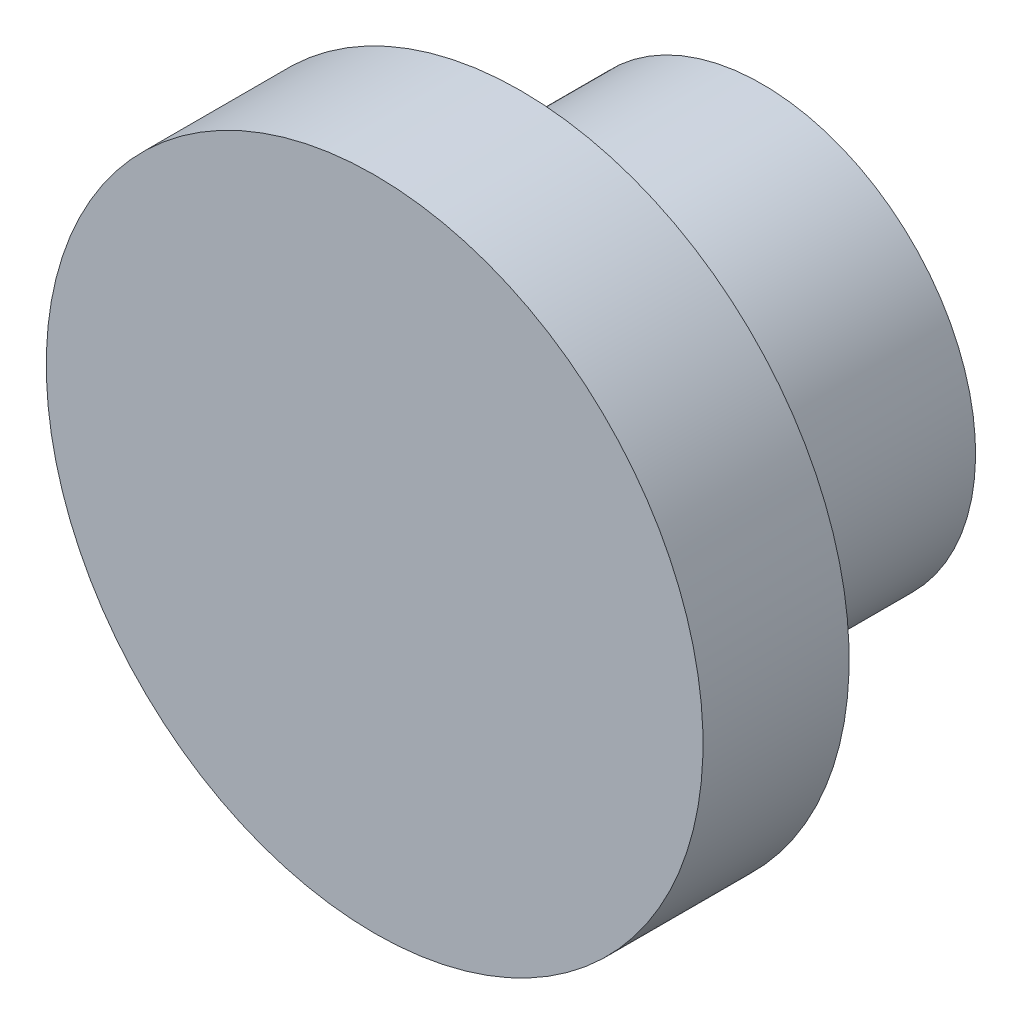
ISO-10303-21;
HEADER;
FILE_DESCRIPTION(('STEP AP214'),'2;1');
FILE_NAME('part.step','',(''),(''),'','','');
FILE_SCHEMA(('AUTOMOTIVE_DESIGN { 1 0 10303 214 1 1 1 1 }'));
ENDSEC;
DATA;
#1=APPLICATION_CONTEXT('core data for automotive mechanical design processes');
#2=APPLICATION_PROTOCOL_DEFINITION('international standard','automotive_design',2000,#1);
#3=PRODUCT_CONTEXT('',#1,'mechanical');
#4=PRODUCT('Part','Part','',(#3));
#5=PRODUCT_RELATED_PRODUCT_CATEGORY('part','',(#4));
#6=PRODUCT_DEFINITION_FORMATION('','',#4);
#7=PRODUCT_DEFINITION_CONTEXT('part definition',#1,'design');
#8=PRODUCT_DEFINITION('design','',#6,#7);
#9=PRODUCT_DEFINITION_SHAPE('','',#8);
#10=(LENGTH_UNIT() NAMED_UNIT(*) SI_UNIT(.MILLI.,.METRE.));
#11=(NAMED_UNIT(*) PLANE_ANGLE_UNIT() SI_UNIT($,.RADIAN.));
#12=(NAMED_UNIT(*) SI_UNIT($,.STERADIAN.) SOLID_ANGLE_UNIT());
#13=UNCERTAINTY_MEASURE_WITH_UNIT(LENGTH_MEASURE(1.E-05),#10,'distance_accuracy_value','');
#14=(GEOMETRIC_REPRESENTATION_CONTEXT(3) GLOBAL_UNCERTAINTY_ASSIGNED_CONTEXT((#13)) GLOBAL_UNIT_ASSIGNED_CONTEXT((#10,
#11,#12)) REPRESENTATION_CONTEXT('',''));
#15=CARTESIAN_POINT('',(0.,0.,0.));
#16=DIRECTION('',(0.,0.,1.));
#17=DIRECTION('',(1.,0.,0.));
#18=AXIS2_PLACEMENT_3D('',#15,#16,#17);
#19=CARTESIAN_POINT('',(0.,0.,-12.8268423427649));
#20=DIRECTION('',(0.,0.,1.));
#21=DIRECTION('',(0.,1.,0.));
#22=AXIS2_PLACEMENT_3D('',#19,#20,#21);
#23=CYLINDRICAL_SURFACE('',#22,13.);
#24=CARTESIAN_POINT('',(0.,0.,-36.4268423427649));
#25=DIRECTION('',(0.,0.,-1.));
#26=DIRECTION('',(0.,-1.,0.));
#27=AXIS2_PLACEMENT_3D('',#24,#25,#26);
#28=CIRCLE('',#27,13.);
#29=CARTESIAN_POINT('',(0.,-13.,-36.4268423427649));
#30=VERTEX_POINT('',#29);
#31=EDGE_CURVE('E10',#30,#30,#28,.F.);
#32=ORIENTED_EDGE('',*,*,#31,.T.);
#33=EDGE_LOOP('',(#32));
#34=FACE_BOUND('',#33,.T.);
#35=CARTESIAN_POINT('',(0.,0.,-21.7268423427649));
#36=DIRECTION('',(0.,0.,-1.));
#37=DIRECTION('',(0.,-1.,0.));
#38=AXIS2_PLACEMENT_3D('',#35,#36,#37);
#39=CIRCLE('',#38,13.);
#40=CARTESIAN_POINT('',(0.,-13.,-21.7268423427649));
#41=VERTEX_POINT('',#40);
#42=EDGE_CURVE('E38',#41,#41,#39,.T.);
#43=ORIENTED_EDGE('',*,*,#42,.T.);
#44=EDGE_LOOP('',(#43));
#45=FACE_BOUND('',#44,.T.);
#46=ADVANCED_FACE('F15',(#34,#45),#23,.T.);
#47=CARTESIAN_POINT('',(0.,0.,-12.8268423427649));
#48=DIRECTION('',(0.,0.,1.));
#49=DIRECTION('',(0.,1.,0.));
#50=AXIS2_PLACEMENT_3D('',#47,#48,#49);
#51=CYLINDRICAL_SURFACE('',#50,9.5);
#52=CARTESIAN_POINT('',(0.,0.,-34.9268423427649));
#53=DIRECTION('',(0.,0.,1.));
#54=DIRECTION('',(0.,1.,0.));
#55=AXIS2_PLACEMENT_3D('',#52,#53,#54);
#56=CIRCLE('',#55,9.5);
#57=CARTESIAN_POINT('',(0.,9.5,-34.9268423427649));
#58=VERTEX_POINT('',#57);
#59=EDGE_CURVE('E26',#58,#58,#56,.T.);
#60=ORIENTED_EDGE('',*,*,#59,.T.);
#61=EDGE_LOOP('',(#60));
#62=FACE_BOUND('',#61,.T.);
#63=CARTESIAN_POINT('',(0.,0.,-36.4268423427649));
#64=DIRECTION('',(0.,0.,1.));
#65=DIRECTION('',(0.,1.,0.));
#66=AXIS2_PLACEMENT_3D('',#63,#64,#65);
#67=CIRCLE('',#66,9.5);
#68=CARTESIAN_POINT('',(0.,9.5,-36.4268423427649));
#69=VERTEX_POINT('',#68);
#70=EDGE_CURVE('E22',#69,#69,#67,.T.);
#71=ORIENTED_EDGE('',*,*,#70,.F.);
#72=EDGE_LOOP('',(#71));
#73=FACE_BOUND('',#72,.T.);
#74=ADVANCED_FACE('F17',(#62,#73),#51,.F.);
#75=CARTESIAN_POINT('',(-9.5,0.,-12.8268423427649));
#76=DIRECTION('',(0.,0.,1.));
#77=DIRECTION('',(0.,1.,0.));
#78=AXIS2_PLACEMENT_3D('',#75,#76,#77);
#79=PLANE('',#78);
#80=CARTESIAN_POINT('',(0.,0.,-12.8268423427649));
#81=DIRECTION('',(0.,0.,-1.));
#82=DIRECTION('',(0.,-1.,0.));
#83=AXIS2_PLACEMENT_3D('',#80,#81,#82);
#84=CIRCLE('',#83,20.);
#85=CARTESIAN_POINT('',(0.,-20.,-12.8268423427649));
#86=VERTEX_POINT('',#85);
#87=EDGE_CURVE('E44',#86,#86,#84,.T.);
#88=ORIENTED_EDGE('',*,*,#87,.F.);
#89=EDGE_LOOP('',(#88));
#90=FACE_BOUND('',#89,.T.);
#91=ADVANCED_FACE('F72',(#90),#79,.T.);
#92=CARTESIAN_POINT('',(-13.,0.,-36.4268423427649));
#93=DIRECTION('',(0.,0.,-1.));
#94=DIRECTION('',(0.,-1.,0.));
#95=AXIS2_PLACEMENT_3D('',#92,#93,#94);
#96=PLANE('',#95);
#97=ORIENTED_EDGE('',*,*,#31,.F.);
#98=EDGE_LOOP('',(#97));
#99=FACE_BOUND('',#98,.T.);
#100=ORIENTED_EDGE('',*,*,#70,.T.);
#101=EDGE_LOOP('',(#100));
#102=FACE_BOUND('',#101,.T.);
#103=ADVANCED_FACE('F76',(#99,#102),#96,.T.);
#104=CARTESIAN_POINT('',(0.,0.,-30.4268423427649));
#105=DIRECTION('',(0.,0.,1.));
#106=DIRECTION('',(0.,1.,0.));
#107=AXIS2_PLACEMENT_3D('',#104,#105,#106);
#108=CONICAL_SURFACE('',#107,10.2934714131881,0.174532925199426);
#109=ORIENTED_EDGE('',*,*,#59,.F.);
#110=EDGE_LOOP('',(#109));
#111=FACE_BOUND('',#110,.T.);
#112=CARTESIAN_POINT('',(0.,0.,-30.4268423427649));
#113=DIRECTION('',(0.,0.,1.));
#114=DIRECTION('',(0.,1.,0.));
#115=AXIS2_PLACEMENT_3D('',#112,#113,#114);
#116=CIRCLE('',#115,10.2934714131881);
#117=CARTESIAN_POINT('',(0.,10.2934714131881,-30.4268423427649));
#118=VERTEX_POINT('',#117);
#119=EDGE_CURVE('E30',#118,#118,#116,.T.);
#120=ORIENTED_EDGE('',*,*,#119,.T.);
#121=EDGE_LOOP('',(#120));
#122=FACE_BOUND('',#121,.T.);
#123=ADVANCED_FACE('F84',(#111,#122),#108,.F.);
#124=CARTESIAN_POINT('',(-10.2934714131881,0.,-30.4268423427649));
#125=DIRECTION('',(0.,0.,-1.));
#126=DIRECTION('',(0.,-1.,0.));
#127=AXIS2_PLACEMENT_3D('',#124,#125,#126);
#128=PLANE('',#127);
#129=ORIENTED_EDGE('',*,*,#119,.F.);
#130=EDGE_LOOP('',(#129));
#131=FACE_BOUND('',#130,.T.);
#132=CARTESIAN_POINT('',(0.,0.,-30.4268423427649));
#133=DIRECTION('',(0.,0.,1.));
#134=DIRECTION('',(0.,1.,0.));
#135=AXIS2_PLACEMENT_3D('',#132,#133,#134);
#136=CIRCLE('',#135,11.6);
#137=CARTESIAN_POINT('',(0.,11.6,-30.4268423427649));
#138=VERTEX_POINT('',#137);
#139=EDGE_CURVE('E35',#138,#138,#136,.T.);
#140=ORIENTED_EDGE('',*,*,#139,.T.);
#141=EDGE_LOOP('',(#140));
#142=FACE_BOUND('',#141,.T.);
#143=ADVANCED_FACE('F92',(#131,#142),#128,.F.);
#144=CARTESIAN_POINT('',(0.,0.,-12.8268423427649));
#145=DIRECTION('',(0.,0.,1.));
#146=DIRECTION('',(0.,1.,0.));
#147=AXIS2_PLACEMENT_3D('',#144,#145,#146);
#148=CYLINDRICAL_SURFACE('',#147,11.6);
#149=CARTESIAN_POINT('',(0.,0.,-20.9268423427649));
#150=DIRECTION('',(0.,0.,1.));
#151=DIRECTION('',(0.,1.,0.));
#152=AXIS2_PLACEMENT_3D('',#149,#150,#151);
#153=CIRCLE('',#152,11.6);
#154=CARTESIAN_POINT('',(0.,11.6,-20.9268423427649));
#155=VERTEX_POINT('',#154);
#156=EDGE_CURVE('E47',#155,#155,#153,.T.);
#157=ORIENTED_EDGE('',*,*,#156,.T.);
#158=EDGE_LOOP('',(#157));
#159=FACE_BOUND('',#158,.T.);
#160=ORIENTED_EDGE('',*,*,#139,.F.);
#161=EDGE_LOOP('',(#160));
#162=FACE_BOUND('',#161,.T.);
#163=ADVANCED_FACE('F51',(#159,#162),#148,.F.);
#164=CARTESIAN_POINT('',(-13.,0.,-21.7268423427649));
#165=DIRECTION('',(0.,0.,1.));
#166=DIRECTION('',(0.,1.,0.));
#167=AXIS2_PLACEMENT_3D('',#164,#165,#166);
#168=PLANE('',#167);
#169=ORIENTED_EDGE('',*,*,#42,.F.);
#170=EDGE_LOOP('',(#169));
#171=FACE_BOUND('',#170,.T.);
#172=CARTESIAN_POINT('',(0.,0.,-21.7268423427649));
#173=DIRECTION('',(0.,0.,-1.));
#174=DIRECTION('',(0.,-1.,0.));
#175=AXIS2_PLACEMENT_3D('',#172,#173,#174);
#176=CIRCLE('',#175,20.);
#177=CARTESIAN_POINT('',(0.,-20.,-21.7268423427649));
#178=VERTEX_POINT('',#177);
#179=EDGE_CURVE('E41',#178,#178,#176,.T.);
#180=ORIENTED_EDGE('',*,*,#179,.T.);
#181=EDGE_LOOP('',(#180));
#182=FACE_BOUND('',#181,.T.);
#183=ADVANCED_FACE('F63',(#171,#182),#168,.F.);
#184=CARTESIAN_POINT('',(0.,0.,-12.8268423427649));
#185=DIRECTION('',(0.,0.,-1.));
#186=DIRECTION('',(0.,-1.,0.));
#187=AXIS2_PLACEMENT_3D('',#184,#185,#186);
#188=CYLINDRICAL_SURFACE('',#187,20.);
#189=ORIENTED_EDGE('',*,*,#179,.F.);
#190=EDGE_LOOP('',(#189));
#191=FACE_BOUND('',#190,.T.);
#192=ORIENTED_EDGE('',*,*,#87,.T.);
#193=EDGE_LOOP('',(#192));
#194=FACE_BOUND('',#193,.T.);
#195=ADVANCED_FACE('F56',(#191,#194),#188,.T.);
#196=CARTESIAN_POINT('',(-11.6,0.,-20.9268423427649));
#197=DIRECTION('',(0.,0.,-1.));
#198=DIRECTION('',(0.,-1.,0.));
#199=AXIS2_PLACEMENT_3D('',#196,#197,#198);
#200=PLANE('',#199);
#201=ORIENTED_EDGE('',*,*,#156,.F.);
#202=EDGE_LOOP('',(#201));
#203=FACE_BOUND('',#202,.T.);
#204=ADVANCED_FACE('F54',(#203),#200,.T.);
#205=CLOSED_SHELL('',(#46,#74,#91,#103,#123,#143,#163,#183,#195,#204));
#206=MANIFOLD_SOLID_BREP('B1',#205);
#207=ADVANCED_BREP_SHAPE_REPRESENTATION('',(#18,#206),#14);
#208=SHAPE_DEFINITION_REPRESENTATION(#9,#207);
ENDSEC;
END-ISO-10303-21;
